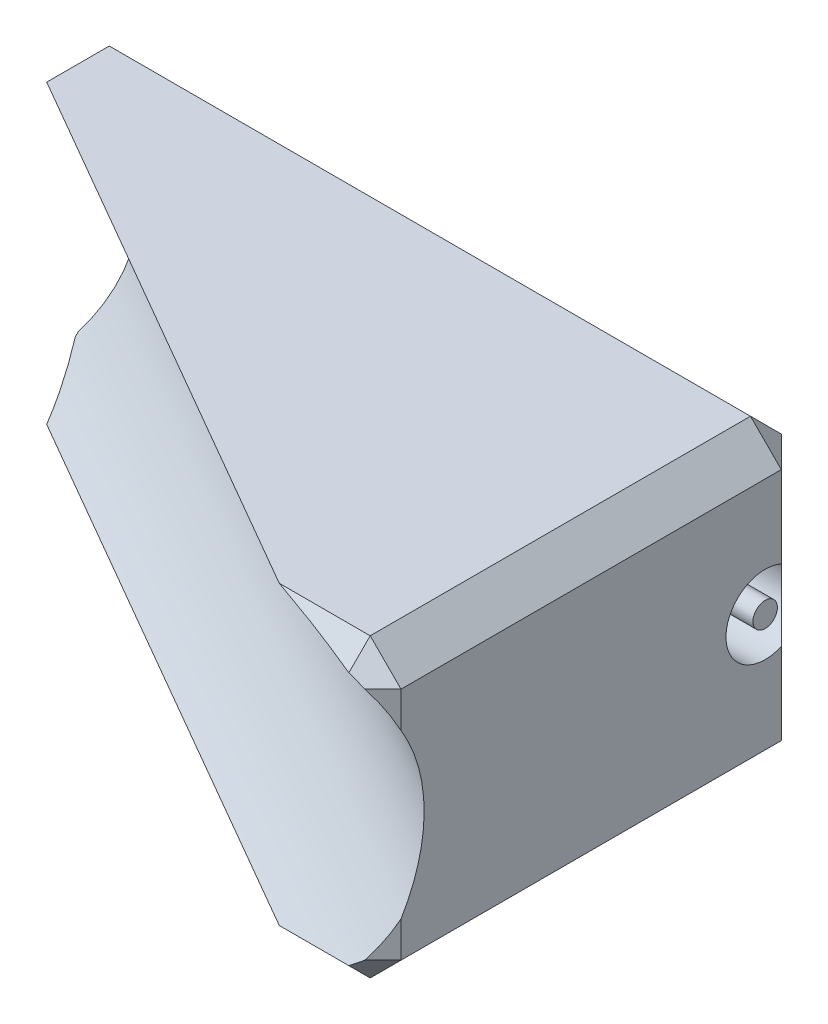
ISO-10303-21;
HEADER;
FILE_DESCRIPTION(('STEP AP214'),'2;1');
FILE_NAME('part.step','',(''),(''),'','','');
FILE_SCHEMA(('AUTOMOTIVE_DESIGN { 1 0 10303 214 1 1 1 1 }'));
ENDSEC;
DATA;
#1=APPLICATION_CONTEXT('core data for automotive mechanical design processes');
#2=APPLICATION_PROTOCOL_DEFINITION('international standard','automotive_design',2000,#1);
#3=PRODUCT_CONTEXT('',#1,'mechanical');
#4=PRODUCT('Part','Part','',(#3));
#5=PRODUCT_RELATED_PRODUCT_CATEGORY('part','',(#4));
#6=PRODUCT_DEFINITION_FORMATION('','',#4);
#7=PRODUCT_DEFINITION_CONTEXT('part definition',#1,'design');
#8=PRODUCT_DEFINITION('design','',#6,#7);
#9=PRODUCT_DEFINITION_SHAPE('','',#8);
#10=(LENGTH_UNIT() NAMED_UNIT(*) SI_UNIT(.MILLI.,.METRE.));
#11=(NAMED_UNIT(*) PLANE_ANGLE_UNIT() SI_UNIT($,.RADIAN.));
#12=(NAMED_UNIT(*) SI_UNIT($,.STERADIAN.) SOLID_ANGLE_UNIT());
#13=UNCERTAINTY_MEASURE_WITH_UNIT(LENGTH_MEASURE(1.E-05),#10,'distance_accuracy_value','');
#14=(GEOMETRIC_REPRESENTATION_CONTEXT(3) GLOBAL_UNCERTAINTY_ASSIGNED_CONTEXT((#13)) GLOBAL_UNIT_ASSIGNED_CONTEXT((#10,
#11,#12)) REPRESENTATION_CONTEXT('',''));
#15=CARTESIAN_POINT('',(0.,0.,0.));
#16=DIRECTION('',(0.,0.,1.));
#17=DIRECTION('',(1.,0.,0.));
#18=AXIS2_PLACEMENT_3D('',#15,#16,#17);
#19=CARTESIAN_POINT('',(127.232621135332,48.07,127.81335182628));
#20=DIRECTION('',(-0.86602540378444,0.,-0.499999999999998));
#21=DIRECTION('',(0.499999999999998,0.,-0.86602540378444));
#22=AXIS2_PLACEMENT_3D('',#19,#20,#21);
#23=CYLINDRICAL_SURFACE('',#22,57.15);
#24=CARTESIAN_POINT('',(-114.,48.07,-11.4623669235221));
#25=DIRECTION('',(1.,0.,0.));
#26=DIRECTION('',(0.,0.,-1.));
#27=AXIS2_PLACEMENT_3D('',#24,#25,#26);
#28=ELLIPSE('',#27,65.9911357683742,57.15);
#29=CARTESIAN_POINT('',(-114.,10.9921832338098,-61.68));
#30=VERTEX_POINT('',#29);
#31=CARTESIAN_POINT('',(-114.,10.,-60.6802173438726));
#32=VERTEX_POINT('',#31);
#33=EDGE_CURVE('E331',#30,#32,#28,.F.);
#34=ORIENTED_EDGE('',*,*,#33,.T.);
#35=CARTESIAN_POINT('',(-152.07,48.07,-33.4420916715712));
#36=DIRECTION('',(-0.707106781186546,-0.707106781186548,0.));
#37=DIRECTION('',(-0.547722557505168,0.547722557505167,-0.632455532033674));
#38=AXIS2_PLACEMENT_3D('',#35,#36,#37);
#39=ELLIPSE('',#38,93.3255592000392,57.15);
#40=CARTESIAN_POINT('',(-104.,0.,-41.380088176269));
#41=VERTEX_POINT('',#40);
#42=EDGE_CURVE('E277',#41,#32,#39,.F.);
#43=ORIENTED_EDGE('',*,*,#42,.F.);
#44=DIRECTION('',(-0.86602540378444,0.,-0.499999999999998));
#45=VECTOR('',#44,1.);
#46=CARTESIAN_POINT('',(142.687374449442,0.,101.044933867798));
#47=LINE('',#46,#45);
#48=CARTESIAN_POINT('',(74.5053089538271,0.,61.6799999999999));
#49=VERTEX_POINT('',#48);
#50=EDGE_CURVE('E209',#49,#41,#47,.T.);
#51=ORIENTED_EDGE('',*,*,#50,.F.);
#52=CARTESIAN_POINT('',(95.9459780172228,48.07,109.75));
#53=DIRECTION('',(0.,-0.707106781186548,0.707106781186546));
#54=DIRECTION('',(-0.925820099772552,-0.267261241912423,-0.267261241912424));
#55=AXIS2_PLACEMENT_3D('',#52,#53,#54);
#56=ELLIPSE('',#55,161.644610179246,57.15);
#57=CARTESIAN_POINT('',(104.,6.92284402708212,68.6028440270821));
#58=VERTEX_POINT('',#57);
#59=EDGE_CURVE('E269',#58,#49,#56,.F.);
#60=ORIENTED_EDGE('',*,*,#59,.F.);
#61=CARTESIAN_POINT('',(101.052023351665,48.07,112.697976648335));
#62=DIRECTION('',(0.577350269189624,-0.577350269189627,0.577350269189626));
#63=DIRECTION('',(-0.66798441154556,-0.740621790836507,-0.0726373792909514));
#64=AXIS2_PLACEMENT_3D('',#61,#62,#63);
#65=ELLIPSE('',#64,72.4632963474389,57.15);
#66=CARTESIAN_POINT('',(108.119477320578,10.,67.5605226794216));
#67=VERTEX_POINT('',#66);
#68=EDGE_CURVE('E257',#67,#58,#65,.F.);
#69=ORIENTED_EDGE('',*,*,#68,.F.);
#70=CARTESIAN_POINT('',(76.9166104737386,48.07,98.7633895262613));
#71=DIRECTION('',(0.707106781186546,0.,0.707106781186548));
#72=DIRECTION('',(-0.707106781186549,0.,0.707106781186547));
#73=AXIS2_PLACEMENT_3D('',#70,#71,#72);
#74=ELLIPSE('',#73,59.1660337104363,57.15);
#75=CARTESIAN_POINT('',(114.,21.6123767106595,61.68));
#76=VERTEX_POINT('',#75);
#77=EDGE_CURVE('E246',#76,#67,#74,.F.);
#78=ORIENTED_EDGE('',*,*,#77,.F.);
#79=CARTESIAN_POINT('',(114.,48.07,120.173494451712));
#80=DIRECTION('',(1.,0.,0.));
#81=DIRECTION('',(0.,0.,-1.));
#82=AXIS2_PLACEMENT_3D('',#79,#80,#81);
#83=ELLIPSE('',#82,65.9911357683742,57.15);
#84=CARTESIAN_POINT('',(114.,74.5276232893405,61.68));
#85=VERTEX_POINT('',#84);
#86=EDGE_CURVE('E202',#85,#76,#83,.F.);
#87=ORIENTED_EDGE('',*,*,#86,.F.);
#88=CARTESIAN_POINT('',(108.119477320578,86.14,67.5605226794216));
#89=VERTEX_POINT('',#88);
#90=EDGE_CURVE('E249',#89,#85,#74,.F.);
#91=ORIENTED_EDGE('',*,*,#90,.F.);
#92=CARTESIAN_POINT('',(101.052023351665,48.07,112.697976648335));
#93=DIRECTION('',(0.577350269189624,0.577350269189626,0.577350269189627));
#94=DIRECTION('',(-0.66798441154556,0.740621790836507,-0.0726373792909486));
#95=AXIS2_PLACEMENT_3D('',#92,#93,#94);
#96=ELLIPSE('',#95,72.4632963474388,57.15);
#97=CARTESIAN_POINT('',(104.,89.2171559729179,68.6028440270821));
#98=VERTEX_POINT('',#97);
#99=EDGE_CURVE('E238',#98,#89,#96,.F.);
#100=ORIENTED_EDGE('',*,*,#99,.F.);
#101=CARTESIAN_POINT('',(95.9459780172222,48.07,109.75));
#102=DIRECTION('',(0.,-0.707106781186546,-0.707106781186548));
#103=DIRECTION('',(-0.925820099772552,0.267261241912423,-0.267261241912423));
#104=AXIS2_PLACEMENT_3D('',#101,#102,#103);
#105=ELLIPSE('',#104,161.644610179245,57.15);
#106=CARTESIAN_POINT('',(74.5053089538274,96.14,61.68));
#107=VERTEX_POINT('',#106);
#108=EDGE_CURVE('E234',#107,#98,#105,.T.);
#109=ORIENTED_EDGE('',*,*,#108,.F.);
#110=DIRECTION('',(-0.86602540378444,0.,-0.499999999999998));
#111=VECTOR('',#110,1.);
#112=CARTESIAN_POINT('',(142.687374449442,96.14,101.044933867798));
#113=LINE('',#112,#111);
#114=CARTESIAN_POINT('',(-104.,96.14,-41.380088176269));
#115=VERTEX_POINT('',#114);
#116=EDGE_CURVE('E359',#107,#115,#113,.T.);
#117=ORIENTED_EDGE('',*,*,#116,.T.);
#118=CARTESIAN_POINT('',(-152.07,48.07,-33.4420916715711));
#119=DIRECTION('',(0.707106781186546,-0.707106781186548,0.));
#120=DIRECTION('',(-0.547722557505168,-0.547722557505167,-0.632455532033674));
#121=AXIS2_PLACEMENT_3D('',#118,#119,#120);
#122=ELLIPSE('',#121,93.3255592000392,57.15);
#123=CARTESIAN_POINT('',(-114.,86.14,-60.6802173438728));
#124=VERTEX_POINT('',#123);
#125=EDGE_CURVE('E231',#124,#115,#122,.T.);
#126=ORIENTED_EDGE('',*,*,#125,.F.);
#127=CARTESIAN_POINT('',(-114.,85.1478167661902,-61.68));
#128=VERTEX_POINT('',#127);
#129=EDGE_CURVE('E326',#124,#128,#28,.F.);
#130=ORIENTED_EDGE('',*,*,#129,.T.);
#131=CARTESIAN_POINT('',(-145.836703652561,48.07,-29.8432963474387));
#132=DIRECTION('',(-0.707106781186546,0.,-0.707106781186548));
#133=DIRECTION('',(-0.707106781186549,0.,0.707106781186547));
#134=AXIS2_PLACEMENT_3D('',#131,#132,#133);
#135=ELLIPSE('',#134,59.1660337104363,57.15);
#136=CARTESIAN_POINT('',(-104.,48.07,-71.68));
#137=VERTEX_POINT('',#136);
#138=EDGE_CURVE('E336',#137,#128,#135,.F.);
#139=ORIENTED_EDGE('',*,*,#138,.F.);
#140=EDGE_CURVE('E223',#30,#137,#135,.F.);
#141=ORIENTED_EDGE('',*,*,#140,.F.);
#142=EDGE_LOOP('',(#34,#43,#51,#60,#69,#78,#87,#91,#100,#109,#117,#126,#130,#139,#141));
#143=FACE_BOUND('',#142,.T.);
#144=CARTESIAN_POINT('',(-66.6050230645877,48.07,-50.09));
#145=CARTESIAN_POINT('',(-66.6050250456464,47.71791765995,-50.0900001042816));
#146=CARTESIAN_POINT('',(-66.6193444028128,47.3657972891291,-50.0945019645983));
#147=CARTESIAN_POINT('',(-66.676480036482,46.6640789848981,-50.1125292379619));
#148=CARTESIAN_POINT('',(-66.7193004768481,46.3144814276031,-50.1260559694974));
#149=CARTESIAN_POINT('',(-66.8330294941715,45.620131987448,-50.1621998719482));
#150=CARTESIAN_POINT('',(-66.9039557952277,45.2753833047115,-50.1848227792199));
#151=CARTESIAN_POINT('',(-67.0731663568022,44.5934248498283,-50.2392468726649));
#152=CARTESIAN_POINT('',(-67.1714496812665,44.2562148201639,-50.2710477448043));
#153=CARTESIAN_POINT('',(-67.394273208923,43.5920234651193,-50.3439088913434));
#154=CARTESIAN_POINT('',(-67.5187852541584,43.2650315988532,-50.3849592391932));
#155=CARTESIAN_POINT('',(-67.7929259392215,42.6231207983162,-50.476484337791));
#156=CARTESIAN_POINT('',(-67.942554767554,42.3082019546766,-50.5269591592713));
#157=CARTESIAN_POINT('',(-68.2655211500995,41.6925524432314,-50.6374943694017));
#158=CARTESIAN_POINT('',(-68.4388572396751,41.3918209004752,-50.6975541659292));
#159=CARTESIAN_POINT('',(-68.8076902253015,40.8064775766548,-50.8274379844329));
#160=CARTESIAN_POINT('',(-69.0031879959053,40.5218664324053,-50.8972623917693));
#161=CARTESIAN_POINT('',(-69.4176896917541,39.9665253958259,-51.047954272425));
#162=CARTESIAN_POINT('',(-69.6369988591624,39.6960635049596,-51.1289699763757));
#163=CARTESIAN_POINT('',(-70.0947837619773,39.1754325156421,-51.3013924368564));
#164=CARTESIAN_POINT('',(-70.3332596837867,38.9252636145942,-51.392799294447));
#165=CARTESIAN_POINT('',(-70.8273900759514,38.4468636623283,-51.5861334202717));
#166=CARTESIAN_POINT('',(-71.083046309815,38.2186348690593,-51.6880617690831));
#167=CARTESIAN_POINT('',(-71.6093935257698,37.7857013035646,-51.9024831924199));
#168=CARTESIAN_POINT('',(-71.8800841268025,37.5809959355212,-52.0149759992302));
#169=CARTESIAN_POINT('',(-72.4374879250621,37.1943212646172,-52.251847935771));
#170=CARTESIAN_POINT('',(-72.724349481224,37.0126402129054,-52.3763487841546));
#171=CARTESIAN_POINT('',(-73.3088354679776,36.6761462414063,-52.6359656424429));
#172=CARTESIAN_POINT('',(-73.6064600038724,36.5213335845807,-52.7710817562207));
#173=CARTESIAN_POINT('',(-74.209991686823,36.239784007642,-53.0515980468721));
#174=CARTESIAN_POINT('',(-74.515898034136,36.1130443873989,-53.1969972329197));
#175=CARTESIAN_POINT('',(-75.1335083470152,35.8886398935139,-53.4975904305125));
#176=CARTESIAN_POINT('',(-75.4452122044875,35.7909744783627,-53.6527842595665));
#177=CARTESIAN_POINT('',(-76.0668495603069,35.6268543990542,-53.9697013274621));
#178=CARTESIAN_POINT('',(-76.3767313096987,35.5599244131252,-54.1312799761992));
#179=CARTESIAN_POINT('',(-76.9972254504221,35.455550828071,-54.4623666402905));
#180=CARTESIAN_POINT('',(-77.3078378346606,35.4181069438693,-54.6318745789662));
#181=CARTESIAN_POINT('',(-77.9273723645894,35.3730239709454,-54.9777232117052));
#182=CARTESIAN_POINT('',(-78.2362946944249,35.3653815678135,-55.1540631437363));
#183=CARTESIAN_POINT('',(-78.8501724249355,35.3799577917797,-55.5123209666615));
#184=CARTESIAN_POINT('',(-79.1551278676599,35.4021761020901,-55.6942387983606));
#185=CARTESIAN_POINT('',(-79.7531744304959,35.4755833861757,-56.0587295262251));
#186=CARTESIAN_POINT('',(-80.0463808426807,35.5262177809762,-56.2412252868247));
#187=CARTESIAN_POINT('',(-80.6249209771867,35.6556378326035,-56.6086838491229));
#188=CARTESIAN_POINT('',(-80.9102548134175,35.7344230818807,-56.7936466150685));
#189=CARTESIAN_POINT('',(-81.471280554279,35.9195282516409,-57.1644319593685));
#190=CARTESIAN_POINT('',(-81.7469720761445,36.0258492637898,-57.350254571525));
#191=CARTESIAN_POINT('',(-82.2870880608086,36.2652141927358,-57.7210586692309));
#192=CARTESIAN_POINT('',(-82.5515123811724,36.3982584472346,-57.9060401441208));
#193=CARTESIAN_POINT('',(-83.069753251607,36.6912854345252,-58.2749169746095));
#194=CARTESIAN_POINT('',(-83.3234653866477,36.8514795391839,-58.4587910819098));
#195=CARTESIAN_POINT('',(-83.8166391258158,37.1968832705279,-58.82209267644));
#196=CARTESIAN_POINT('',(-84.0561006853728,37.3820929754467,-59.0015201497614));
#197=CARTESIAN_POINT('',(-84.5196285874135,37.7762691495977,-59.3541334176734));
#198=CARTESIAN_POINT('',(-84.7436931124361,37.9852384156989,-59.5273184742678));
#199=CARTESIAN_POINT('',(-85.1753557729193,38.4255164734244,-59.8656286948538));
#200=CARTESIAN_POINT('',(-85.3829536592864,38.6568256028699,-60.0307537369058));
#201=CARTESIAN_POINT('',(-85.7852024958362,39.1456815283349,-60.3547696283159));
#202=CARTESIAN_POINT('',(-85.9794600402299,39.4036994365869,-60.513438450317));
#203=CARTESIAN_POINT('',(-86.3488974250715,39.9397692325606,-60.8186941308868));
#204=CARTESIAN_POINT('',(-86.5240769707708,40.2178214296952,-60.9652808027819));
#205=CARTESIAN_POINT('',(-86.8545577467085,40.792101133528,-61.2446413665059));
#206=CARTESIAN_POINT('',(-87.009858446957,41.0883291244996,-61.3774148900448));
#207=CARTESIAN_POINT('',(-87.2998516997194,41.6969523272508,-61.627520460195));
#208=CARTESIAN_POINT('',(-87.4345443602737,42.0093474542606,-61.7448525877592));
#209=CARTESIAN_POINT('',(-87.6829608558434,42.6488957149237,-61.9628405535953));
#210=CARTESIAN_POINT('',(-87.7966362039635,42.9760808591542,-62.063457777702));
#211=CARTESIAN_POINT('',(-88.0020718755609,43.6422479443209,-62.2463688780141));
#212=CARTESIAN_POINT('',(-88.0938321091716,43.9812299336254,-62.3286626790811));
#213=CARTESIAN_POINT('',(-88.2549523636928,44.6685106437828,-62.4738030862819));
#214=CARTESIAN_POINT('',(-88.3243151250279,45.0168082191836,-62.536652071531));
#215=CARTESIAN_POINT('',(-88.4402831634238,45.7201975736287,-62.642041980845));
#216=CARTESIAN_POINT('',(-88.4868888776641,46.0752892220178,-62.6845832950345));
#217=CARTESIAN_POINT('',(-88.5563687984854,46.7822916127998,-62.7480993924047));
#218=CARTESIAN_POINT('',(-88.5797095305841,47.1341185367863,-62.7694980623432));
#219=CARTESIAN_POINT('',(-88.6041872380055,47.8391893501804,-62.7919407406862));
#220=CARTESIAN_POINT('',(-88.6053245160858,48.1924332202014,-62.7929850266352));
#221=CARTESIAN_POINT('',(-88.5853902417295,48.8977407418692,-62.7747054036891));
#222=CARTESIAN_POINT('',(-88.5643201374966,49.2498044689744,-62.7553828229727));
#223=CARTESIAN_POINT('',(-88.5000867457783,49.9502178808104,-62.6966377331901));
#224=CARTESIAN_POINT('',(-88.4569235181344,50.2985675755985,-62.6572152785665));
#225=CARTESIAN_POINT('',(-88.3493497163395,50.9851134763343,-62.5593690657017));
#226=CARTESIAN_POINT('',(-88.2851867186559,51.3233801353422,-62.501166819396));
#227=CARTESIAN_POINT('',(-88.1358163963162,51.9914986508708,-62.3664048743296));
#228=CARTESIAN_POINT('',(-88.0506092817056,52.3213505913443,-62.2898453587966));
#229=CARTESIAN_POINT('',(-87.8595599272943,52.9704326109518,-62.119339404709));
#230=CARTESIAN_POINT('',(-87.7537163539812,53.2896620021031,-62.0253918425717));
#231=CARTESIAN_POINT('',(-87.52189467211,53.91536900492,-61.8212764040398));
#232=CARTESIAN_POINT('',(-87.3959162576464,54.2218464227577,-61.7111082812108));
#233=CARTESIAN_POINT('',(-87.1224062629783,54.8244467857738,-61.4741493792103));
#234=CARTESIAN_POINT('',(-86.9745859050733,55.1203521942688,-61.3471386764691));
#235=CARTESIAN_POINT('',(-86.6594761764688,55.6950448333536,-61.0792975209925));
#236=CARTESIAN_POINT('',(-86.4921866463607,55.9738319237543,-60.9384669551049));
#237=CARTESIAN_POINT('',(-86.1388632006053,56.5125053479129,-60.6445974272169));
#238=CARTESIAN_POINT('',(-85.9528270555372,56.7723894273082,-60.4915570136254));
#239=CARTESIAN_POINT('',(-85.5628537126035,57.2715271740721,-60.1749977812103));
#240=CARTESIAN_POINT('',(-85.3589163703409,57.5107806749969,-60.0114788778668));
#241=CARTESIAN_POINT('',(-84.9299995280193,57.9714387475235,-59.6725343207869));
#242=CARTESIAN_POINT('',(-84.7046926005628,58.1924152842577,-59.4969409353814));
#243=CARTESIAN_POINT('',(-84.2375291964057,58.6097563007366,-59.1386507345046));
#244=CARTESIAN_POINT('',(-83.9956724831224,58.8061204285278,-58.9559538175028));
#245=CARTESIAN_POINT('',(-83.4966470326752,59.1728103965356,-58.5854223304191));
#246=CARTESIAN_POINT('',(-83.2394786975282,59.3431369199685,-58.397587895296));
#247=CARTESIAN_POINT('',(-82.7112170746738,59.6564774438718,-58.0187424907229));
#248=CARTESIAN_POINT('',(-82.4401239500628,59.7994917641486,-57.8277315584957));
#249=CARTESIAN_POINT('',(-81.8871778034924,60.0563508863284,-57.4455772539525));
#250=CARTESIAN_POINT('',(-81.6053957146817,60.1703588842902,-57.2544409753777));
#251=CARTESIAN_POINT('',(-81.0313445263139,60.3693591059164,-56.872802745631));
#252=CARTESIAN_POINT('',(-80.7390754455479,60.4543513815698,-56.6823007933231));
#253=CARTESIAN_POINT('',(-80.1460086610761,60.5946048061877,-56.3037312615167));
#254=CARTESIAN_POINT('',(-79.8452121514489,60.6498700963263,-56.1156633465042));
#255=CARTESIAN_POINT('',(-79.2371461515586,60.7302161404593,-55.7435909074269));
#256=CARTESIAN_POINT('',(-78.9298767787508,60.7552974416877,-55.5595863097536));
#257=CARTESIAN_POINT('',(-78.3180951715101,60.7748383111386,-55.2012331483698));
#258=CARTESIAN_POINT('',(-78.0136771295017,60.7699759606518,-55.0267603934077));
#259=CARTESIAN_POINT('',(-77.4030112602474,60.7312506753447,-54.6843676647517));
#260=CARTESIAN_POINT('',(-77.0967634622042,60.6973882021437,-54.5164475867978));
#261=CARTESIAN_POINT('',(-76.4847250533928,60.6009425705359,-54.1882156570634));
#262=CARTESIAN_POINT('',(-76.1789344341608,60.5383599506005,-54.0279036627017));
#263=CARTESIAN_POINT('',(-75.5701238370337,60.3849795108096,-53.7157442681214));
#264=CARTESIAN_POINT('',(-75.2671038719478,60.2941815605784,-53.5638969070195));
#265=CARTESIAN_POINT('',(-74.6672833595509,60.0854749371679,-53.2698863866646));
#266=CARTESIAN_POINT('',(-74.3704638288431,59.9676686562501,-53.1276892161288));
#267=CARTESIAN_POINT('',(-73.7841584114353,59.7056487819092,-52.8528423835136));
#268=CARTESIAN_POINT('',(-73.4946724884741,59.5614353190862,-52.7201926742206));
#269=CARTESIAN_POINT('',(-72.925234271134,59.2476344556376,-52.4647475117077));
#270=CARTESIAN_POINT('',(-72.6452827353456,59.0780450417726,-52.341952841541));
#271=CARTESIAN_POINT('',(-72.0970926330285,58.7146822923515,-52.1064039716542));
#272=CARTESIAN_POINT('',(-71.828854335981,58.5209084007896,-51.9936500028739));
#273=CARTESIAN_POINT('',(-71.300727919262,58.1062016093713,-51.7759986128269));
#274=CARTESIAN_POINT('',(-71.041130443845,57.8847867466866,-51.6713139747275));
#275=CARTESIAN_POINT('',(-70.5384473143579,57.4196226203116,-51.4724411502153));
#276=CARTESIAN_POINT('',(-70.2953619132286,57.1758730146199,-51.3782531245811));
#277=CARTESIAN_POINT('',(-69.8276831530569,56.6676091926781,-51.2002504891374));
#278=CARTESIAN_POINT('',(-69.6030940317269,56.4030902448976,-51.1164382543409));
#279=CARTESIAN_POINT('',(-69.1743982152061,55.8550870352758,-50.9590632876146));
#280=CARTESIAN_POINT('',(-68.9702914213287,55.5716028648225,-50.8855005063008));
#281=CARTESIAN_POINT('',(-68.5817508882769,54.9835855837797,-50.7475209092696));
#282=CARTESIAN_POINT('',(-68.3976206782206,54.6788195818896,-50.6832412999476));
#283=CARTESIAN_POINT('',(-68.0539884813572,54.0538179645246,-50.5648415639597));
#284=CARTESIAN_POINT('',(-67.8944863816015,53.7335824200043,-50.5107213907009));
#285=CARTESIAN_POINT('',(-67.601773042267,53.0801172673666,-50.4124938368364));
#286=CARTESIAN_POINT('',(-67.4685430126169,52.7468971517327,-50.3683792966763));
#287=CARTESIAN_POINT('',(-67.2295947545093,52.0696512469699,-50.2899557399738));
#288=CARTESIAN_POINT('',(-67.123871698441,51.7256273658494,-50.2556450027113));
#289=CARTESIAN_POINT('',(-66.9618214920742,51.1085120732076,-50.2033961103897));
#290=CARTESIAN_POINT('',(-66.899728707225,50.8370819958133,-50.1835090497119));
#291=CARTESIAN_POINT('',(-66.7929937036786,50.2904644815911,-50.1494530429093));
#292=CARTESIAN_POINT('',(-66.7483501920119,50.0152773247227,-50.1352836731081));
#293=CARTESIAN_POINT('',(-66.6768004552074,49.4623462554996,-50.1126261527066));
#294=CARTESIAN_POINT('',(-66.649895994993,49.1846020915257,-50.1041385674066));
#295=CARTESIAN_POINT('',(-66.6140083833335,48.6279130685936,-50.0928260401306));
#296=CARTESIAN_POINT('',(-66.6050214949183,48.3489684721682,-50.0899999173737));
#297=CARTESIAN_POINT('',(-66.6050230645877,48.07,-50.09));
#298=B_SPLINE_CURVE_WITH_KNOTS('',3,(#144,#145,#146,#147,#148,#149,#150,#151,#152,#153,#154,
#155,#156,#157,#158,#159,#160,#161,#162,#163,#164,#165,#166,#167,#168,#169,#170,#171,#172,#173,
#174,#175,#176,#177,#178,#179,#180,#181,#182,#183,#184,#185,#186,#187,#188,#189,#190,#191,#192,
#193,#194,#195,#196,#197,#198,#199,#200,#201,#202,#203,#204,#205,#206,#207,#208,#209,#210,#211,
#212,#213,#214,#215,#216,#217,#218,#219,#220,#221,#222,#223,#224,#225,#226,#227,#228,#229,#230,
#231,#232,#233,#234,#235,#236,#237,#238,#239,#240,#241,#242,#243,#244,#245,#246,#247,#248,#249,
#250,#251,#252,#253,#254,#255,#256,#257,#258,#259,#260,#261,#262,#263,#264,#265,#266,#267,#268,
#269,#270,#271,#272,#273,#274,#275,#276,#277,#278,#279,#280,#281,#282,#283,#284,#285,#286,#287,
#288,#289,#290,#291,#292,#293,#294,#295,#296,#297),.UNSPECIFIED.,.T.,.F.,(4,2,2,2,2,2,2,2,2,2,2,
2,2,2,2,2,2,2,2,2,2,2,2,2,2,2,2,2,2,2,2,2,2,2,2,2,2,2,2,2,2,2,2,2,2,2,2,2,2,2,2,2,2,2,2,2,2,2,2,
2,2,2,2,2,2,2,2,2,2,2,2,2,2,2,2,2,4),(0.,1.05599403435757,2.11214237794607,3.16895781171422,
4.22573708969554,5.28138758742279,6.33704600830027,7.39263923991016,8.44827414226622,
9.51954274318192,10.5908217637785,11.6622109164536,12.7335729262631,13.817244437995,
14.9009265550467,15.9845043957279,17.0680620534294,18.1342460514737,19.2004197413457,
20.2664748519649,21.3325186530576,22.3784465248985,23.4243592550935,24.4703134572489,
25.5162808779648,26.5708008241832,27.6253240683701,28.6799715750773,29.7346350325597,
30.8128864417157,31.8911545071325,32.9694513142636,34.0477424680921,35.1284910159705,
36.2092439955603,37.2898646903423,38.3704646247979,39.4289312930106,40.4873835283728,
41.5457667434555,42.6041470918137,43.6504739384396,44.6967903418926,45.7431743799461,
46.7895743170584,47.851307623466,48.9130496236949,49.9749180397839,51.0367950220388,
52.1189474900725,53.2011154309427,54.2832549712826,55.3653818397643,56.4412786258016,
57.5171734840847,58.5929184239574,59.6686438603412,60.7201001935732,61.7715397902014,
62.8229596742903,63.8743844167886,64.9218871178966,65.9693846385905,67.0169653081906,
68.0645700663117,69.134013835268,70.203473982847,71.2731784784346,72.3428778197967,
73.4270497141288,74.5112166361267,75.5946053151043,76.6778037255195,77.5146620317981,
78.3514583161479,79.188337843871,80.0250428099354),.UNSPECIFIED.);
#299=CARTESIAN_POINT('',(-76.2256555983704,35.5962573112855,-54.0534243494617));
#300=VERTEX_POINT('',#299);
#301=CARTESIAN_POINT('',(-76.2256555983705,60.5437426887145,-54.0534243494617));
#302=VERTEX_POINT('',#301);
#303=EDGE_CURVE('E65',#300,#302,#298,.T.);
#304=ORIENTED_EDGE('',*,*,#303,.T.);
#305=CARTESIAN_POINT('',(-86.1752294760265,60.3008757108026,-59.8598946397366));
#306=CARTESIAN_POINT('',(-85.8943235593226,60.3496690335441,-59.6853674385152));
#307=CARTESIAN_POINT('',(-85.6124623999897,60.3943307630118,-59.5112612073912));
#308=CARTESIAN_POINT('',(-85.0470413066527,60.4757127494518,-59.163990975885));
#309=CARTESIAN_POINT('',(-84.7634814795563,60.5124335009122,-58.9908269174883));
#310=CARTESIAN_POINT('',(-83.9107198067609,60.6111518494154,-58.4729879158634));
#311=CARTESIAN_POINT('',(-83.3392369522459,60.6617395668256,-58.1298426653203));
#312=CARTESIAN_POINT('',(-82.1919658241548,60.734534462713,-57.448420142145));
#313=CARTESIAN_POINT('',(-81.6161794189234,60.7567533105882,-57.1101409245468));
#314=CARTESIAN_POINT('',(-80.4611909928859,60.7744402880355,-56.438654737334));
#315=CARTESIAN_POINT('',(-79.8819886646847,60.7699059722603,-56.1054482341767));
#316=CARTESIAN_POINT('',(-78.714326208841,60.7350348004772,-55.4404620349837));
#317=CARTESIAN_POINT('',(-78.1258384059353,60.7043888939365,-55.1087474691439));
#318=CARTESIAN_POINT('',(-76.9475222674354,60.6176748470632,-54.4510619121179));
#319=CARTESIAN_POINT('',(-76.3576939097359,60.5616062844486,-54.1250910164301));
#320=CARTESIAN_POINT('',(-75.1777214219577,60.4244378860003,-53.4791067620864));
#321=CARTESIAN_POINT('',(-74.5875773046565,60.3433389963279,-53.1590931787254));
#322=CARTESIAN_POINT('',(-73.4079815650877,60.1560951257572,-52.5252158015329));
#323=CARTESIAN_POINT('',(-72.8185299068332,60.0499515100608,-52.2113516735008));
#324=CARTESIAN_POINT('',(-71.8391311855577,59.8520935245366,-51.6943664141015));
#325=CARTESIAN_POINT('',(-71.4486740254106,59.7675073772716,-51.4894577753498));
#326=CARTESIAN_POINT('',(-70.6689175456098,59.5868227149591,-51.0825415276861));
#327=CARTESIAN_POINT('',(-70.2796181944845,59.4907245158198,-50.8805338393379));
#328=CARTESIAN_POINT('',(-69.5025658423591,59.2866502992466,-50.4795155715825));
#329=CARTESIAN_POINT('',(-69.1148129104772,59.1786737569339,-50.2805051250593));
#330=CARTESIAN_POINT('',(-68.3413444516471,58.9503588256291,-49.8856266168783));
#331=CARTESIAN_POINT('',(-67.9556289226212,58.8300204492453,-49.6897585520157));
#332=CARTESIAN_POINT('',(-67.1885967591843,58.5769421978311,-49.3022502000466));
#333=CARTESIAN_POINT('',(-66.8072679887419,58.4442629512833,-49.1105944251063));
#334=CARTESIAN_POINT('',(-66.0478740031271,58.1652392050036,-48.7308058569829));
#335=CARTESIAN_POINT('',(-65.6698086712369,58.0188951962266,-48.5426729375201));
#336=CARTESIAN_POINT('',(-64.9179399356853,57.7116024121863,-48.17031115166));
#337=CARTESIAN_POINT('',(-64.5441346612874,57.550660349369,-47.9860805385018));
#338=CARTESIAN_POINT('',(-63.801720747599,57.2128729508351,-47.621860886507));
#339=CARTESIAN_POINT('',(-63.4331113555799,57.0360299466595,-47.4418712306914));
#340=CARTESIAN_POINT('',(-62.7723041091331,56.7003196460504,-47.1206261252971));
#341=CARTESIAN_POINT('',(-62.478970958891,56.5444796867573,-46.9785442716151));
#342=CARTESIAN_POINT('',(-61.89756523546,56.2203046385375,-46.6979001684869));
#343=CARTESIAN_POINT('',(-61.6094924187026,56.0519701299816,-46.5593377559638));
#344=CARTESIAN_POINT('',(-61.0390855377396,55.7010890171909,-46.2858828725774));
#345=CARTESIAN_POINT('',(-60.7567686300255,55.5185060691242,-46.1510010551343));
#346=CARTESIAN_POINT('',(-60.2003217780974,55.138005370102,-45.8859930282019));
#347=CARTESIAN_POINT('',(-59.9261915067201,54.9400882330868,-45.7558666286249));
#348=CARTESIAN_POINT('',(-59.385111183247,54.5246252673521,-45.4997947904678));
#349=CARTESIAN_POINT('',(-59.118286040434,54.3068731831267,-45.3739178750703));
#350=CARTESIAN_POINT('',(-58.598334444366,53.8514756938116,-45.1293243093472));
#351=CARTESIAN_POINT('',(-58.3452136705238,53.6138221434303,-45.0106106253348));
#352=CARTESIAN_POINT('',(-57.8582331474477,53.1172097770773,-44.7828122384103));
#353=CARTESIAN_POINT('',(-57.6242985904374,52.8583424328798,-44.6736900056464));
#354=CARTESIAN_POINT('',(-57.1809973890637,52.316219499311,-44.4673822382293));
#355=CARTESIAN_POINT('',(-56.9716002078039,52.0329950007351,-44.3701818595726));
#356=CARTESIAN_POINT('',(-56.5940585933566,51.4529458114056,-44.1952683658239));
#357=CARTESIAN_POINT('',(-56.4245191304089,51.1572433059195,-44.1168930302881));
#358=CARTESIAN_POINT('',(-56.1255184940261,50.5416539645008,-43.9788647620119));
#359=CARTESIAN_POINT('',(-55.996030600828,50.2217834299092,-43.9191993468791));
#360=CARTESIAN_POINT('',(-55.8396923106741,49.7254570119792,-43.8472244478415));
#361=CARTESIAN_POINT('',(-55.7937323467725,49.556170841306,-43.8260787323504));
#362=CARTESIAN_POINT('',(-55.7162089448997,49.2135927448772,-43.7904230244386));
#363=CARTESIAN_POINT('',(-55.6846450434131,49.0403009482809,-43.775912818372));
#364=CARTESIAN_POINT('',(-55.6369782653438,48.6913239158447,-43.7540037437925));
#365=CARTESIAN_POINT('',(-55.620860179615,48.5156412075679,-43.7465978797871));
#366=CARTESIAN_POINT('',(-55.6045901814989,48.1633839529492,-43.7391222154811));
#367=CARTESIAN_POINT('',(-55.6044366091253,47.9868095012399,-43.7390516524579));
#368=CARTESIAN_POINT('',(-55.619169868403,47.65525339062,-43.7458212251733));
#369=CARTESIAN_POINT('',(-55.6322913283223,47.5001727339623,-43.7518502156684));
#370=CARTESIAN_POINT('',(-55.6706059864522,47.1917828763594,-43.7694596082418));
#371=CARTESIAN_POINT('',(-55.6958031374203,47.0384742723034,-43.781041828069));
#372=CARTESIAN_POINT('',(-55.7576404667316,46.7346381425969,-43.8094772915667));
#373=CARTESIAN_POINT('',(-55.7942847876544,46.5841116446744,-43.8263324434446));
#374=CARTESIAN_POINT('',(-55.8781689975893,46.2866695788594,-43.8649357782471));
#375=CARTESIAN_POINT('',(-55.9254115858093,46.1397549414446,-43.8866852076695));
#376=CARTESIAN_POINT('',(-56.0477121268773,45.7995856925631,-43.9430238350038));
#377=CARTESIAN_POINT('',(-56.1267236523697,45.6080505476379,-43.9794451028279));
#378=CARTESIAN_POINT('',(-56.2998638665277,45.2334698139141,-44.0593368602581));
#379=CARTESIAN_POINT('',(-56.3939988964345,45.0504278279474,-44.1028103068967));
#380=CARTESIAN_POINT('',(-56.5952584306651,44.6928231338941,-44.1958634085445));
#381=CARTESIAN_POINT('',(-56.7024072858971,44.518277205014,-44.245454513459));
#382=CARTESIAN_POINT('',(-56.9274844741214,44.1779909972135,-44.3497589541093));
#383=CARTESIAN_POINT('',(-57.0454113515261,44.0122495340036,-44.4044715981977));
#384=CARTESIAN_POINT('',(-57.3750404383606,43.5774513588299,-44.5576170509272));
#385=CARTESIAN_POINT('',(-57.5951933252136,43.3162152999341,-44.660117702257));
#386=CARTESIAN_POINT('',(-58.0548805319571,42.8156362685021,-44.8747122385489));
#387=CARTESIAN_POINT('',(-58.2944291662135,42.576309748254,-44.9868132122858));
#388=CARTESIAN_POINT('',(-58.7886333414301,42.1168692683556,-45.2187454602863));
#389=CARTESIAN_POINT('',(-59.0433172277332,41.8967933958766,-45.3385912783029));
#390=CARTESIAN_POINT('',(-59.563927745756,41.4742565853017,-45.5843161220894));
#391=CARTESIAN_POINT('',(-59.8298520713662,41.2717920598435,-45.7101939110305));
#392=CARTESIAN_POINT('',(-60.3810810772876,40.8749556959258,-45.9719530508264));
#393=CARTESIAN_POINT('',(-60.6667371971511,40.6812060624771,-46.10803306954));
#394=CARTESIAN_POINT('',(-61.2456393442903,40.3088167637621,-46.3847603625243));
#395=CARTESIAN_POINT('',(-61.5388870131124,40.130180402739,-46.5254086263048));
#396=CARTESIAN_POINT('',(-62.1316628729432,39.7864495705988,-46.8107364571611));
#397=CARTESIAN_POINT('',(-62.4311962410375,39.6213668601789,-46.9554193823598));
#398=CARTESIAN_POINT('',(-63.0351264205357,39.3037135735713,-47.2482173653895));
#399=CARTESIAN_POINT('',(-63.3395229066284,39.151142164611,-47.3963321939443));
#400=CARTESIAN_POINT('',(-63.9532580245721,38.8570399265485,-47.6961109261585));
#401=CARTESIAN_POINT('',(-64.2626090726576,38.7155448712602,-47.8477844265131));
#402=CARTESIAN_POINT('',(-64.8846041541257,38.4432997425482,-48.1539532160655));
#403=CARTESIAN_POINT('',(-65.1972481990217,38.3125497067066,-48.3084485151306));
#404=CARTESIAN_POINT('',(-66.1390085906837,37.9354405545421,-48.7757228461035));
#405=CARTESIAN_POINT('',(-66.7722333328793,37.704090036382,-49.0924270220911));
#406=CARTESIAN_POINT('',(-68.0152826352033,37.2876238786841,-49.7195113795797));
#407=CARTESIAN_POINT('',(-68.6247654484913,37.1008181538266,-50.0294615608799));
#408=CARTESIAN_POINT('',(-69.8483493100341,36.7573633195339,-50.6570744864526));
#409=CARTESIAN_POINT('',(-70.4624510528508,36.6007188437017,-50.9747384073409));
#410=CARTESIAN_POINT('',(-71.6940360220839,36.3159479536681,-51.6175604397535));
#411=CARTESIAN_POINT('',(-72.3115217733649,36.1878470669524,-51.9427249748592));
#412=CARTESIAN_POINT('',(-73.54791473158,35.9594696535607,-52.5999403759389));
#413=CARTESIAN_POINT('',(-74.1668218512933,35.8591914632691,-52.9319908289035));
#414=CARTESIAN_POINT('',(-75.403232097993,35.686369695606,-53.6018623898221));
#415=CARTESIAN_POINT('',(-76.0207346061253,35.6137534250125,-53.9396659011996));
#416=CARTESIAN_POINT('',(-77.2548718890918,35.4960769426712,-54.6216991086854));
#417=CARTESIAN_POINT('',(-77.8715066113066,35.4510183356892,-54.9659291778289));
#418=CARTESIAN_POINT('',(-79.1021714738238,35.3891739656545,-55.6602450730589));
#419=CARTESIAN_POINT('',(-79.7162034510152,35.3723629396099,-56.0103253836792));
#420=CARTESIAN_POINT('',(-80.940930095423,35.3681001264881,-56.7163007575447));
#421=CARTESIAN_POINT('',(-81.551625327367,35.3806432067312,-57.072194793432));
#422=CARTESIAN_POINT('',(-82.4984064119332,35.424319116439,-57.630275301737));
#423=CARTESIAN_POINT('',(-82.836112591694,35.4447347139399,-57.8305992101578));
#424=CARTESIAN_POINT('',(-83.5097909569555,35.4955448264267,-58.2328091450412));
#425=CARTESIAN_POINT('',(-83.8457633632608,35.5259380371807,-58.4346949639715));
#426=CARTESIAN_POINT('',(-84.5153416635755,35.5970825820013,-58.8397040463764));
#427=CARTESIAN_POINT('',(-84.8489498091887,35.6378221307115,-59.0428256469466));
#428=CARTESIAN_POINT('',(-85.5138906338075,35.7301844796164,-59.4504036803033));
#429=CARTESIAN_POINT('',(-85.8452230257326,35.7818086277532,-59.6548602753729));
#430=CARTESIAN_POINT('',(-86.1752294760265,35.8391242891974,-59.8598946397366));
#431=B_SPLINE_CURVE_WITH_KNOTS('',3,(#305,#306,#307,#308,#309,#310,#311,#312,#313,#314,#315,
#316,#317,#318,#319,#320,#321,#322,#323,#324,#325,#326,#327,#328,#329,#330,#331,#332,#333,#334,
#335,#336,#337,#338,#339,#340,#341,#342,#343,#344,#345,#346,#347,#348,#349,#350,#351,#352,#353,
#354,#355,#356,#357,#358,#359,#360,#361,#362,#363,#364,#365,#366,#367,#368,#369,#370,#371,#372,
#373,#374,#375,#376,#377,#378,#379,#380,#381,#382,#383,#384,#385,#386,#387,#388,#389,#390,#391,
#392,#393,#394,#395,#396,#397,#398,#399,#400,#401,#402,#403,#404,#405,#406,#407,#408,#409,#410,
#411,#412,#413,#414,#415,#416,#417,#418,#419,#420,#421,#422,#423,#424,#425,#426,#427,#428,#429,
#430),.UNSPECIFIED.,.F.,.F.,(4,2,2,2,2,2,2,2,2,2,2,2,2,2,2,2,2,2,2,2,2,2,2,2,2,2,2,2,2,2,2,2,2,
2,2,2,2,2,2,2,2,2,2,2,2,2,2,2,2,2,2,2,2,2,2,2,2,2,2,2,2,2,4),(0.,1.0028025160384,
2.00554256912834,4.01031390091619,6.01426031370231,8.01838989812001,10.0465747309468,
12.0747932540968,14.1029351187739,16.1309664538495,17.4778195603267,18.824635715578,
20.1715114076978,21.5183857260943,22.8589612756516,24.1994886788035,25.5394027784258,
26.8791207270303,27.9627017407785,29.0462324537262,30.1326234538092,31.2189709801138,
32.3182971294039,33.4180754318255,34.5133387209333,35.6072241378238,36.6536788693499,
37.6994339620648,38.2288489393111,38.7582468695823,39.2871229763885,39.8159440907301,
40.28262010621,40.7494489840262,41.2164469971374,41.6835640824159,42.3136864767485,
42.9440737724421,43.5756593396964,44.2071597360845,45.2753937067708,46.3444233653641,
47.4155223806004,48.4864027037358,49.5989864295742,50.7118127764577,51.8255947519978,
52.9393025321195,54.0564704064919,55.1736421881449,57.4069713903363,59.53274302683,
61.6588409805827,63.7868328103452,65.9146973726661,68.036930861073,70.1592879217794,
72.2797458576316,74.3998330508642,75.5792655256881,76.7585438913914,77.9364849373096,
79.1145719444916),.UNSPECIFIED.);
#432=EDGE_CURVE('E190',#302,#300,#431,.T.);
#433=ORIENTED_EDGE('',*,*,#432,.T.);
#434=EDGE_LOOP('',(#304,#433));
#435=FACE_BOUND('',#434,.T.);
#436=ADVANCED_FACE('F52',(#143,#435),#23,.F.);
#437=CARTESIAN_POINT('',(114.,96.14,-71.68));
#438=DIRECTION('',(1.,0.,0.));
#439=DIRECTION('',(0.,0.,-1.));
#440=AXIS2_PLACEMENT_3D('',#437,#438,#439);
#441=PLANE('',#440);
#442=DIRECTION('',(0.,1.,0.));
#443=VECTOR('',#442,1.);
#444=CARTESIAN_POINT('',(114.,96.14,-61.6799999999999));
#445=LINE('',#444,#443);
#446=CARTESIAN_POINT('',(114.,10.,-61.6799999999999));
#447=VERTEX_POINT('',#446);
#448=CARTESIAN_POINT('',(114.,36.5014045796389,-61.6799999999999));
#449=VERTEX_POINT('',#448);
#450=EDGE_CURVE('E178',#447,#449,#445,.T.);
#451=ORIENTED_EDGE('',*,*,#450,.T.);
#452=CARTESIAN_POINT('',(114.,48.07,-56.44));
#453=DIRECTION('',(1.,0.,0.));
#454=DIRECTION('',(0.,0.,-1.));
#455=AXIS2_PLACEMENT_3D('',#452,#453,#454);
#456=CIRCLE('',#455,12.7);
#457=CARTESIAN_POINT('',(114.,59.6385954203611,-61.6799999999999));
#458=VERTEX_POINT('',#457);
#459=EDGE_CURVE('E169',#449,#458,#456,.F.);
#460=ORIENTED_EDGE('',*,*,#459,.T.);
#461=CARTESIAN_POINT('',(114.,86.14,-61.6799999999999));
#462=VERTEX_POINT('',#461);
#463=EDGE_CURVE('E177',#458,#462,#445,.T.);
#464=ORIENTED_EDGE('',*,*,#463,.T.);
#465=DIRECTION('',(0.,0.,1.));
#466=VECTOR('',#465,1.);
#467=CARTESIAN_POINT('',(114.,86.14,71.68));
#468=LINE('',#467,#466);
#469=CARTESIAN_POINT('',(114.,86.14,61.68));
#470=VERTEX_POINT('',#469);
#471=EDGE_CURVE('E196',#462,#470,#468,.T.);
#472=ORIENTED_EDGE('',*,*,#471,.T.);
#473=DIRECTION('',(0.,-1.,0.));
#474=VECTOR('',#473,1.);
#475=CARTESIAN_POINT('',(114.,0.,61.68));
#476=LINE('',#475,#474);
#477=EDGE_CURVE('E198',#470,#85,#476,.T.);
#478=ORIENTED_EDGE('',*,*,#477,.T.);
#479=ORIENTED_EDGE('',*,*,#86,.T.);
#480=CARTESIAN_POINT('',(114.,10.,61.68));
#481=VERTEX_POINT('',#480);
#482=EDGE_CURVE('E204',#76,#481,#476,.T.);
#483=ORIENTED_EDGE('',*,*,#482,.T.);
#484=DIRECTION('',(0.,0.,-1.));
#485=VECTOR('',#484,1.);
#486=CARTESIAN_POINT('',(114.,10.,-71.68));
#487=LINE('',#486,#485);
#488=EDGE_CURVE('E188',#481,#447,#487,.T.);
#489=ORIENTED_EDGE('',*,*,#488,.T.);
#490=EDGE_LOOP('',(#451,#460,#464,#472,#478,#479,#483,#489));
#491=FACE_BOUND('',#490,.T.);
#492=ADVANCED_FACE('F54',(#491),#441,.T.);
#493=CARTESIAN_POINT('',(104.,10.,-71.68));
#494=DIRECTION('',(0.577350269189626,-0.577350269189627,-0.577350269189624));
#495=DIRECTION('',(0.707106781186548,0.707106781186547,0.));
#496=AXIS2_PLACEMENT_3D('',#493,#494,#495);
#497=PLANE('',#496);
#498=DIRECTION('',(0.707106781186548,0.707106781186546,0.));
#499=VECTOR('',#498,1.);
#500=CARTESIAN_POINT('',(109.,5.00000000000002,-61.6799999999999));
#501=LINE('',#500,#499);
#502=CARTESIAN_POINT('',(104.,0.,-61.6799999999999));
#503=VERTEX_POINT('',#502);
#504=EDGE_CURVE('E215',#503,#447,#501,.T.);
#505=ORIENTED_EDGE('',*,*,#504,.F.);
#506=DIRECTION('',(0.,-0.707106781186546,0.707106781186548));
#507=VECTOR('',#506,1.);
#508=CARTESIAN_POINT('',(104.,10.,-71.68));
#509=LINE('',#508,#507);
#510=CARTESIAN_POINT('',(104.,10.,-71.68));
#511=VERTEX_POINT('',#510);
#512=EDGE_CURVE('E262',#503,#511,#509,.F.);
#513=ORIENTED_EDGE('',*,*,#512,.T.);
#514=DIRECTION('',(-0.707106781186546,0.,-0.707106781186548));
#515=VECTOR('',#514,1.);
#516=CARTESIAN_POINT('',(104.,10.,-71.68));
#517=LINE('',#516,#515);
#518=EDGE_CURVE('E185',#447,#511,#517,.T.);
#519=ORIENTED_EDGE('',*,*,#518,.F.);
#520=EDGE_LOOP('',(#505,#513,#519));
#521=FACE_BOUND('',#520,.T.);
#522=ADVANCED_FACE('F321',(#521),#497,.T.);
#523=CARTESIAN_POINT('',(104.,86.14,-71.68));
#524=DIRECTION('',(0.577350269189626,0.577350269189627,-0.577350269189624));
#525=DIRECTION('',(-0.707106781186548,0.707106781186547,0.));
#526=AXIS2_PLACEMENT_3D('',#523,#524,#525);
#527=PLANE('',#526);
#528=DIRECTION('',(0.707106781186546,0.,0.707106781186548));
#529=VECTOR('',#528,1.);
#530=CARTESIAN_POINT('',(104.,86.14,-71.68));
#531=LINE('',#530,#529);
#532=CARTESIAN_POINT('',(104.,86.14,-71.68));
#533=VERTEX_POINT('',#532);
#534=EDGE_CURVE('E260',#462,#533,#531,.F.);
#535=ORIENTED_EDGE('',*,*,#534,.T.);
#536=DIRECTION('',(0.,0.707106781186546,0.707106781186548));
#537=VECTOR('',#536,1.);
#538=CARTESIAN_POINT('',(104.,86.14,-71.68));
#539=LINE('',#538,#537);
#540=CARTESIAN_POINT('',(104.,96.14,-61.6799999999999));
#541=VERTEX_POINT('',#540);
#542=EDGE_CURVE('E186',#533,#541,#539,.T.);
#543=ORIENTED_EDGE('',*,*,#542,.T.);
#544=DIRECTION('',(0.707106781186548,-0.707106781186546,0.));
#545=VECTOR('',#544,1.);
#546=CARTESIAN_POINT('',(109.,91.14,-61.6799999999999));
#547=LINE('',#546,#545);
#548=EDGE_CURVE('E245',#462,#541,#547,.F.);
#549=ORIENTED_EDGE('',*,*,#548,.F.);
#550=EDGE_LOOP('',(#535,#543,#549));
#551=FACE_BOUND('',#550,.T.);
#552=ADVANCED_FACE('F389',(#551),#527,.T.);
#553=CARTESIAN_POINT('',(104.,96.14,-71.68));
#554=DIRECTION('',(-0.707106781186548,0.,0.707106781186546));
#555=DIRECTION('',(0.,-1.,0.));
#556=AXIS2_PLACEMENT_3D('',#553,#554,#555);
#557=PLANE('',#556);
#558=ORIENTED_EDGE('',*,*,#463,.F.);
#559=CARTESIAN_POINT('',(119.24,48.07,-56.44));
#560=DIRECTION('',(-0.707106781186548,0.,0.707106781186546));
#561=DIRECTION('',(0.707106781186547,0.,0.707106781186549));
#562=AXIS2_PLACEMENT_3D('',#559,#560,#561);
#563=ELLIPSE('',#562,17.9605122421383,12.7);
#564=EDGE_CURVE('E173',#458,#449,#563,.T.);
#565=ORIENTED_EDGE('',*,*,#564,.T.);
#566=ORIENTED_EDGE('',*,*,#450,.F.);
#567=ORIENTED_EDGE('',*,*,#518,.T.);
#568=DIRECTION('',(0.,-1.,0.));
#569=VECTOR('',#568,1.);
#570=CARTESIAN_POINT('',(104.,96.14,-71.68));
#571=LINE('',#570,#569);
#572=EDGE_CURVE('E343',#533,#511,#571,.T.);
#573=ORIENTED_EDGE('',*,*,#572,.F.);
#574=ORIENTED_EDGE('',*,*,#534,.F.);
#575=EDGE_LOOP('',(#558,#565,#566,#567,#573,#574));
#576=FACE_BOUND('',#575,.T.);
#577=ADVANCED_FACE('F182',(#576),#557,.F.);
#578=CARTESIAN_POINT('',(-114.,86.14,-71.68));
#579=DIRECTION('',(0.,0.707106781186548,-0.707106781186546));
#580=DIRECTION('',(-1.,0.,0.));
#581=AXIS2_PLACEMENT_3D('',#578,#579,#580);
#582=PLANE('',#581);
#583=ORIENTED_EDGE('',*,*,#542,.F.);
#584=DIRECTION('',(1.,0.,0.));
#585=VECTOR('',#584,1.);
#586=CARTESIAN_POINT('',(114.,86.14,-71.68));
#587=LINE('',#586,#585);
#588=CARTESIAN_POINT('',(-104.,86.14,-71.68));
#589=VERTEX_POINT('',#588);
#590=EDGE_CURVE('E289',#589,#533,#587,.T.);
#591=ORIENTED_EDGE('',*,*,#590,.F.);
#592=DIRECTION('',(0.,-0.707106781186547,-0.707106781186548));
#593=VECTOR('',#592,1.);
#594=CARTESIAN_POINT('',(-104.,96.14,-61.6799999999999));
#595=LINE('',#594,#593);
#596=CARTESIAN_POINT('',(-104.,96.14,-61.6799999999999));
#597=VERTEX_POINT('',#596);
#598=EDGE_CURVE('E265',#597,#589,#595,.T.);
#599=ORIENTED_EDGE('',*,*,#598,.F.);
#600=DIRECTION('',(-1.,0.,0.));
#601=VECTOR('',#600,1.);
#602=CARTESIAN_POINT('',(-114.,96.14,-61.6799999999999));
#603=LINE('',#602,#601);
#604=EDGE_CURVE('E299',#541,#597,#603,.T.);
#605=ORIENTED_EDGE('',*,*,#604,.F.);
#606=EDGE_LOOP('',(#583,#591,#599,#605));
#607=FACE_BOUND('',#606,.T.);
#608=ADVANCED_FACE('F385',(#607),#582,.T.);
#609=CARTESIAN_POINT('',(0.,0.,-61.6799999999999));
#610=DIRECTION('',(0.,0.707106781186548,0.707106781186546));
#611=DIRECTION('',(1.,0.,0.));
#612=AXIS2_PLACEMENT_3D('',#609,#610,#611);
#613=PLANE('',#612);
#614=DIRECTION('',(0.,0.707106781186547,-0.707106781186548));
#615=VECTOR('',#614,1.);
#616=CARTESIAN_POINT('',(-104.,10.,-71.68));
#617=LINE('',#616,#615);
#618=CARTESIAN_POINT('',(-104.,10.,-71.68));
#619=VERTEX_POINT('',#618);
#620=CARTESIAN_POINT('',(-104.,0.,-61.6799999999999));
#621=VERTEX_POINT('',#620);
#622=EDGE_CURVE('E219',#619,#621,#617,.F.);
#623=ORIENTED_EDGE('',*,*,#622,.F.);
#624=DIRECTION('',(-1.,0.,0.));
#625=VECTOR('',#624,1.);
#626=CARTESIAN_POINT('',(-114.,10.,-71.68));
#627=LINE('',#626,#625);
#628=EDGE_CURVE('E294',#511,#619,#627,.T.);
#629=ORIENTED_EDGE('',*,*,#628,.F.);
#630=ORIENTED_EDGE('',*,*,#512,.F.);
#631=DIRECTION('',(1.,0.,0.));
#632=VECTOR('',#631,1.);
#633=CARTESIAN_POINT('',(0.,0.,-61.6799999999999));
#634=LINE('',#633,#632);
#635=EDGE_CURVE('E208',#621,#503,#634,.T.);
#636=ORIENTED_EDGE('',*,*,#635,.F.);
#637=EDGE_LOOP('',(#623,#629,#630,#636));
#638=FACE_BOUND('',#637,.T.);
#639=ADVANCED_FACE('F439',(#638),#613,.F.);
#640=CARTESIAN_POINT('',(-104.,10.,-71.68));
#641=DIRECTION('',(-0.577350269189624,-0.577350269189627,-0.577350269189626));
#642=DIRECTION('',(0.,0.707106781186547,-0.707106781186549));
#643=AXIS2_PLACEMENT_3D('',#640,#641,#642);
#644=PLANE('',#643);
#645=DIRECTION('',(0.707106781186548,0.,-0.707106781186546));
#646=VECTOR('',#645,1.);
#647=CARTESIAN_POINT('',(-104.,10.,-71.68));
#648=LINE('',#647,#646);
#649=CARTESIAN_POINT('',(-114.,10.,-61.68));
#650=VERTEX_POINT('',#649);
#651=EDGE_CURVE('E274',#619,#650,#648,.F.);
#652=ORIENTED_EDGE('',*,*,#651,.F.);
#653=ORIENTED_EDGE('',*,*,#622,.T.);
#654=DIRECTION('',(-0.707106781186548,0.707106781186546,0.));
#655=VECTOR('',#654,1.);
#656=CARTESIAN_POINT('',(-109.,5.00000000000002,-61.68));
#657=LINE('',#656,#655);
#658=EDGE_CURVE('E60',#650,#621,#657,.F.);
#659=ORIENTED_EDGE('',*,*,#658,.F.);
#660=EDGE_LOOP('',(#652,#653,#659));
#661=FACE_BOUND('',#660,.T.);
#662=ADVANCED_FACE('F503',(#661),#644,.T.);
#663=CARTESIAN_POINT('',(0.,0.,0.));
#664=DIRECTION('',(0.,-1.,0.));
#665=DIRECTION('',(0.,0.,-1.));
#666=AXIS2_PLACEMENT_3D('',#663,#664,#665);
#667=PLANE('',#666);
#668=DIRECTION('',(-1.,0.,0.));
#669=VECTOR('',#668,1.);
#670=CARTESIAN_POINT('',(-114.,0.,61.6799999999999));
#671=LINE('',#670,#669);
#672=CARTESIAN_POINT('',(104.,0.,61.6799999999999));
#673=VERTEX_POINT('',#672);
#674=EDGE_CURVE('E216',#673,#49,#671,.T.);
#675=ORIENTED_EDGE('',*,*,#674,.T.);
#676=ORIENTED_EDGE('',*,*,#50,.T.);
#677=DIRECTION('',(0.,0.,-1.));
#678=VECTOR('',#677,1.);
#679=CARTESIAN_POINT('',(-104.,0.,-71.68));
#680=LINE('',#679,#678);
#681=EDGE_CURVE('E206',#41,#621,#680,.T.);
#682=ORIENTED_EDGE('',*,*,#681,.T.);
#683=ORIENTED_EDGE('',*,*,#635,.T.);
#684=DIRECTION('',(0.,0.,1.));
#685=VECTOR('',#684,1.);
#686=CARTESIAN_POINT('',(104.,0.,0.));
#687=LINE('',#686,#685);
#688=EDGE_CURVE('E212',#503,#673,#687,.T.);
#689=ORIENTED_EDGE('',*,*,#688,.T.);
#690=EDGE_LOOP('',(#675,#676,#682,#683,#689));
#691=FACE_BOUND('',#690,.T.);
#692=ADVANCED_FACE('F446',(#691),#667,.T.);
#693=CARTESIAN_POINT('',(104.,0.,0.));
#694=DIRECTION('',(-0.707106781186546,0.707106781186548,0.));
#695=DIRECTION('',(0.,0.,1.));
#696=AXIS2_PLACEMENT_3D('',#693,#694,#695);
#697=PLANE('',#696);
#698=ORIENTED_EDGE('',*,*,#504,.T.);
#699=ORIENTED_EDGE('',*,*,#488,.F.);
#700=DIRECTION('',(-0.707106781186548,-0.707106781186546,0.));
#701=VECTOR('',#700,1.);
#702=CARTESIAN_POINT('',(114.,10.,61.68));
#703=LINE('',#702,#701);
#704=EDGE_CURVE('E256',#673,#481,#703,.F.);
#705=ORIENTED_EDGE('',*,*,#704,.F.);
#706=ORIENTED_EDGE('',*,*,#688,.F.);
#707=EDGE_LOOP('',(#698,#699,#705,#706));
#708=FACE_BOUND('',#707,.T.);
#709=ADVANCED_FACE('F442',(#708),#697,.F.);
#710=CARTESIAN_POINT('',(-114.,10.,71.68));
#711=DIRECTION('',(0.,-0.707106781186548,0.707106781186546));
#712=DIRECTION('',(-1.,0.,0.));
#713=AXIS2_PLACEMENT_3D('',#710,#711,#712);
#714=PLANE('',#713);
#715=DIRECTION('',(0.,-0.707106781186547,-0.707106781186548));
#716=VECTOR('',#715,1.);
#717=CARTESIAN_POINT('',(104.,5.00000000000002,66.68));
#718=LINE('',#717,#716);
#719=EDGE_CURVE('E254',#58,#673,#718,.T.);
#720=ORIENTED_EDGE('',*,*,#719,.F.);
#721=ORIENTED_EDGE('',*,*,#59,.T.);
#722=ORIENTED_EDGE('',*,*,#674,.F.);
#723=EDGE_LOOP('',(#720,#721,#722));
#724=FACE_BOUND('',#723,.T.);
#725=ADVANCED_FACE('F445',(#724),#714,.T.);
#726=CARTESIAN_POINT('',(-104.,96.14,-61.6799999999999));
#727=DIRECTION('',(-0.577350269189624,0.577350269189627,-0.577350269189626));
#728=DIRECTION('',(0.,0.707106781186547,0.707106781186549));
#729=AXIS2_PLACEMENT_3D('',#726,#727,#728);
#730=PLANE('',#729);
#731=ORIENTED_EDGE('',*,*,#598,.T.);
#732=DIRECTION('',(-0.707106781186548,0.,0.707106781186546));
#733=VECTOR('',#732,1.);
#734=CARTESIAN_POINT('',(-109.,86.14,-66.68));
#735=LINE('',#734,#733);
#736=CARTESIAN_POINT('',(-114.,86.14,-61.68));
#737=VERTEX_POINT('',#736);
#738=EDGE_CURVE('E268',#589,#737,#735,.T.);
#739=ORIENTED_EDGE('',*,*,#738,.T.);
#740=DIRECTION('',(-0.707106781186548,-0.707106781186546,0.));
#741=VECTOR('',#740,1.);
#742=CARTESIAN_POINT('',(-104.,96.14,-61.6799999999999));
#743=LINE('',#742,#741);
#744=EDGE_CURVE('E250',#597,#737,#743,.T.);
#745=ORIENTED_EDGE('',*,*,#744,.F.);
#746=EDGE_LOOP('',(#731,#739,#745));
#747=FACE_BOUND('',#746,.T.);
#748=ADVANCED_FACE('F395',(#747),#730,.T.);
#749=CARTESIAN_POINT('',(114.,10.,61.68));
#750=DIRECTION('',(0.577350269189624,-0.577350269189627,0.577350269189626));
#751=DIRECTION('',(0.,-0.707106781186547,-0.707106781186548));
#752=AXIS2_PLACEMENT_3D('',#749,#750,#751);
#753=PLANE('',#752);
#754=DIRECTION('',(-0.707106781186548,0.,0.707106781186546));
#755=VECTOR('',#754,1.);
#756=CARTESIAN_POINT('',(114.,10.,61.68));
#757=LINE('',#756,#755);
#758=EDGE_CURVE('E242',#67,#481,#757,.F.);
#759=ORIENTED_EDGE('',*,*,#758,.F.);
#760=ORIENTED_EDGE('',*,*,#68,.T.);
#761=ORIENTED_EDGE('',*,*,#719,.T.);
#762=ORIENTED_EDGE('',*,*,#704,.T.);
#763=EDGE_LOOP('',(#759,#760,#761,#762));
#764=FACE_BOUND('',#763,.T.);
#765=ADVANCED_FACE('F453',(#764),#753,.T.);
#766=CARTESIAN_POINT('',(114.,96.14,61.68));
#767=DIRECTION('',(0.707106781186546,0.,0.707106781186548));
#768=DIRECTION('',(0.,1.,0.));
#769=AXIS2_PLACEMENT_3D('',#766,#767,#768);
#770=PLANE('',#769);
#771=ORIENTED_EDGE('',*,*,#482,.F.);
#772=ORIENTED_EDGE('',*,*,#77,.T.);
#773=ORIENTED_EDGE('',*,*,#758,.T.);
#774=EDGE_LOOP('',(#771,#772,#773));
#775=FACE_BOUND('',#774,.T.);
#776=ADVANCED_FACE('F458',(#775),#770,.T.);
#777=CARTESIAN_POINT('',(114.,86.14,-71.68));
#778=DIRECTION('',(0.707106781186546,0.707106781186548,0.));
#779=DIRECTION('',(0.,0.,-1.));
#780=AXIS2_PLACEMENT_3D('',#777,#778,#779);
#781=PLANE('',#780);
#782=ORIENTED_EDGE('',*,*,#548,.T.);
#783=DIRECTION('',(0.,0.,-1.));
#784=VECTOR('',#783,1.);
#785=CARTESIAN_POINT('',(104.,96.14,-71.68));
#786=LINE('',#785,#784);
#787=CARTESIAN_POINT('',(104.,96.14,61.68));
#788=VERTEX_POINT('',#787);
#789=EDGE_CURVE('E296',#788,#541,#786,.T.);
#790=ORIENTED_EDGE('',*,*,#789,.F.);
#791=DIRECTION('',(-0.707106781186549,0.707106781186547,0.));
#792=VECTOR('',#791,1.);
#793=CARTESIAN_POINT('',(104.,96.14,61.68));
#794=LINE('',#793,#792);
#795=EDGE_CURVE('E237',#470,#788,#794,.T.);
#796=ORIENTED_EDGE('',*,*,#795,.F.);
#797=ORIENTED_EDGE('',*,*,#471,.F.);
#798=EDGE_LOOP('',(#782,#790,#796,#797));
#799=FACE_BOUND('',#798,.T.);
#800=ADVANCED_FACE('F377',(#799),#781,.T.);
#801=DIRECTION('',(0.707106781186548,0.,-0.707106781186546));
#802=VECTOR('',#801,1.);
#803=CARTESIAN_POINT('',(109.,86.14,66.68));
#804=LINE('',#803,#802);
#805=EDGE_CURVE('E235',#89,#470,#804,.T.);
#806=ORIENTED_EDGE('',*,*,#805,.F.);
#807=ORIENTED_EDGE('',*,*,#90,.T.);
#808=ORIENTED_EDGE('',*,*,#477,.F.);
#809=EDGE_LOOP('',(#806,#807,#808));
#810=FACE_BOUND('',#809,.T.);
#811=ADVANCED_FACE('F373',(#810),#770,.T.);
#812=CARTESIAN_POINT('',(104.,96.14,61.68));
#813=DIRECTION('',(0.577350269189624,0.577350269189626,0.577350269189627));
#814=DIRECTION('',(0.,-0.707106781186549,0.707106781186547));
#815=AXIS2_PLACEMENT_3D('',#812,#813,#814);
#816=PLANE('',#815);
#817=DIRECTION('',(0.,0.707106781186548,-0.707106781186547));
#818=VECTOR('',#817,1.);
#819=CARTESIAN_POINT('',(104.,96.14,61.68));
#820=LINE('',#819,#818);
#821=EDGE_CURVE('E228',#98,#788,#820,.T.);
#822=ORIENTED_EDGE('',*,*,#821,.F.);
#823=ORIENTED_EDGE('',*,*,#99,.T.);
#824=ORIENTED_EDGE('',*,*,#805,.T.);
#825=ORIENTED_EDGE('',*,*,#795,.T.);
#826=EDGE_LOOP('',(#822,#823,#824,#825));
#827=FACE_BOUND('',#826,.T.);
#828=ADVANCED_FACE('F366',(#827),#816,.T.);
#829=CARTESIAN_POINT('',(0.,96.14,0.));
#830=DIRECTION('',(0.,-1.,0.));
#831=DIRECTION('',(0.,0.,-1.));
#832=AXIS2_PLACEMENT_3D('',#829,#830,#831);
#833=PLANE('',#832);
#834=ORIENTED_EDGE('',*,*,#116,.F.);
#835=DIRECTION('',(1.,0.,0.));
#836=VECTOR('',#835,1.);
#837=CARTESIAN_POINT('',(0.,96.14,61.68));
#838=LINE('',#837,#836);
#839=EDGE_CURVE('E241',#107,#788,#838,.T.);
#840=ORIENTED_EDGE('',*,*,#839,.T.);
#841=ORIENTED_EDGE('',*,*,#789,.T.);
#842=ORIENTED_EDGE('',*,*,#604,.T.);
#843=DIRECTION('',(0.,0.,1.));
#844=VECTOR('',#843,1.);
#845=CARTESIAN_POINT('',(-104.,96.14,0.));
#846=LINE('',#845,#844);
#847=EDGE_CURVE('E285',#597,#115,#846,.T.);
#848=ORIENTED_EDGE('',*,*,#847,.T.);
#849=EDGE_LOOP('',(#834,#840,#841,#842,#848));
#850=FACE_BOUND('',#849,.T.);
#851=ADVANCED_FACE('F317',(#850),#833,.F.);
#852=CARTESIAN_POINT('',(0.,96.14,61.68));
#853=DIRECTION('',(0.,-0.707106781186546,-0.707106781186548));
#854=DIRECTION('',(1.,0.,0.));
#855=AXIS2_PLACEMENT_3D('',#852,#853,#854);
#856=PLANE('',#855);
#857=ORIENTED_EDGE('',*,*,#839,.F.);
#858=ORIENTED_EDGE('',*,*,#108,.T.);
#859=ORIENTED_EDGE('',*,*,#821,.T.);
#860=EDGE_LOOP('',(#857,#858,#859));
#861=FACE_BOUND('',#860,.T.);
#862=ADVANCED_FACE('F402',(#861),#856,.F.);
#863=CARTESIAN_POINT('',(-114.,96.14,-71.68));
#864=DIRECTION('',(1.,0.,0.));
#865=DIRECTION('',(0.,0.,-1.));
#866=AXIS2_PLACEMENT_3D('',#863,#864,#865);
#867=PLANE('',#866);
#868=ORIENTED_EDGE('',*,*,#129,.F.);
#869=DIRECTION('',(0.,0.,-1.));
#870=VECTOR('',#869,1.);
#871=CARTESIAN_POINT('',(-114.,86.14,-71.68));
#872=LINE('',#871,#870);
#873=EDGE_CURVE('E225',#124,#737,#872,.T.);
#874=ORIENTED_EDGE('',*,*,#873,.T.);
#875=DIRECTION('',(0.,-1.,0.));
#876=VECTOR('',#875,1.);
#877=CARTESIAN_POINT('',(-114.,0.,-61.68));
#878=LINE('',#877,#876);
#879=EDGE_CURVE('E227',#737,#128,#878,.T.);
#880=ORIENTED_EDGE('',*,*,#879,.T.);
#881=EDGE_LOOP('',(#868,#874,#880));
#882=FACE_BOUND('',#881,.T.);
#883=ADVANCED_FACE('F404',(#882),#867,.F.);
#884=CARTESIAN_POINT('',(-104.,96.14,0.));
#885=DIRECTION('',(0.707106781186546,-0.707106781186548,0.));
#886=DIRECTION('',(0.,0.,1.));
#887=AXIS2_PLACEMENT_3D('',#884,#885,#886);
#888=PLANE('',#887);
#889=ORIENTED_EDGE('',*,*,#873,.F.);
#890=ORIENTED_EDGE('',*,*,#125,.T.);
#891=ORIENTED_EDGE('',*,*,#847,.F.);
#892=ORIENTED_EDGE('',*,*,#744,.T.);
#893=EDGE_LOOP('',(#889,#890,#891,#892));
#894=FACE_BOUND('',#893,.T.);
#895=ADVANCED_FACE('F399',(#894),#888,.F.);
#896=CARTESIAN_POINT('',(-114.,96.14,-71.68));
#897=DIRECTION('',(0.,0.,-1.));
#898=DIRECTION('',(-1.,0.,0.));
#899=AXIS2_PLACEMENT_3D('',#896,#897,#898);
#900=PLANE('',#899);
#901=DIRECTION('',(0.,1.,0.));
#902=VECTOR('',#901,1.);
#903=CARTESIAN_POINT('',(-104.,96.14,-71.68));
#904=LINE('',#903,#902);
#905=EDGE_CURVE('E253',#619,#137,#904,.T.);
#906=ORIENTED_EDGE('',*,*,#905,.T.);
#907=EDGE_CURVE('E286',#137,#589,#904,.T.);
#908=ORIENTED_EDGE('',*,*,#907,.T.);
#909=ORIENTED_EDGE('',*,*,#590,.T.);
#910=ORIENTED_EDGE('',*,*,#572,.T.);
#911=ORIENTED_EDGE('',*,*,#628,.T.);
#912=EDGE_LOOP('',(#906,#908,#909,#910,#911));
#913=FACE_BOUND('',#912,.T.);
#914=ADVANCED_FACE('F391',(#913),#900,.T.);
#915=CARTESIAN_POINT('',(-114.,96.14,-61.68));
#916=DIRECTION('',(-0.707106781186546,0.,-0.707106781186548));
#917=DIRECTION('',(0.,1.,0.));
#918=AXIS2_PLACEMENT_3D('',#915,#916,#917);
#919=PLANE('',#918);
#920=ORIENTED_EDGE('',*,*,#907,.F.);
#921=ORIENTED_EDGE('',*,*,#138,.T.);
#922=ORIENTED_EDGE('',*,*,#879,.F.);
#923=ORIENTED_EDGE('',*,*,#738,.F.);
#924=EDGE_LOOP('',(#920,#921,#922,#923));
#925=FACE_BOUND('',#924,.T.);
#926=ADVANCED_FACE('F393',(#925),#919,.T.);
#927=ORIENTED_EDGE('',*,*,#33,.F.);
#928=EDGE_CURVE('E224',#30,#650,#878,.T.);
#929=ORIENTED_EDGE('',*,*,#928,.T.);
#930=DIRECTION('',(0.,0.,1.));
#931=VECTOR('',#930,1.);
#932=CARTESIAN_POINT('',(-114.,10.,71.68));
#933=LINE('',#932,#931);
#934=EDGE_CURVE('E220',#650,#32,#933,.T.);
#935=ORIENTED_EDGE('',*,*,#934,.T.);
#936=EDGE_LOOP('',(#927,#929,#935));
#937=FACE_BOUND('',#936,.T.);
#938=ADVANCED_FACE('F412',(#937),#867,.F.);
#939=ORIENTED_EDGE('',*,*,#928,.F.);
#940=ORIENTED_EDGE('',*,*,#140,.T.);
#941=ORIENTED_EDGE('',*,*,#905,.F.);
#942=ORIENTED_EDGE('',*,*,#651,.T.);
#943=EDGE_LOOP('',(#939,#940,#941,#942));
#944=FACE_BOUND('',#943,.T.);
#945=ADVANCED_FACE('F425',(#944),#919,.T.);
#946=CARTESIAN_POINT('',(-114.,10.,-71.68));
#947=DIRECTION('',(-0.707106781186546,-0.707106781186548,0.));
#948=DIRECTION('',(0.,0.,-1.));
#949=AXIS2_PLACEMENT_3D('',#946,#947,#948);
#950=PLANE('',#949);
#951=ORIENTED_EDGE('',*,*,#681,.F.);
#952=ORIENTED_EDGE('',*,*,#42,.T.);
#953=ORIENTED_EDGE('',*,*,#934,.F.);
#954=ORIENTED_EDGE('',*,*,#658,.T.);
#955=EDGE_LOOP('',(#951,#952,#953,#954));
#956=FACE_BOUND('',#955,.T.);
#957=ADVANCED_FACE('F316',(#956),#950,.T.);
#958=CARTESIAN_POINT('',(-93.8347122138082,48.07,-56.44));
#959=DIRECTION('',(1.,0.,0.));
#960=DIRECTION('',(0.,1.,0.));
#961=AXIS2_PLACEMENT_3D('',#958,#959,#960);
#962=CYLINDRICAL_SURFACE('',#961,12.7);
#963=ORIENTED_EDGE('',*,*,#459,.F.);
#964=ORIENTED_EDGE('',*,*,#564,.F.);
#965=EDGE_LOOP('',(#963,#964));
#966=FACE_BOUND('',#965,.T.);
#967=CARTESIAN_POINT('',(-77.6035456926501,48.07,-56.44));
#968=DIRECTION('',(0.86602540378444,0.,-0.499999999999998));
#969=DIRECTION('',(-0.499999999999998,0.,-0.86602540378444));
#970=AXIS2_PLACEMENT_3D('',#967,#968,#969);
#971=ELLIPSE('',#970,14.6646968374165,12.7);
#972=EDGE_CURVE('E12',#300,#302,#971,.T.);
#973=ORIENTED_EDGE('',*,*,#972,.F.);
#974=ORIENTED_EDGE('',*,*,#432,.F.);
#975=EDGE_LOOP('',(#973,#974));
#976=FACE_BOUND('',#975,.T.);
#977=ADVANCED_FACE('F171',(#966,#976),#962,.F.);
#978=CARTESIAN_POINT('',(-139.833545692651,48.07,51.345521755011));
#979=DIRECTION('',(0.500000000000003,0.,-0.866025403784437));
#980=DIRECTION('',(0.866025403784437,0.,0.500000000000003));
#981=AXIS2_PLACEMENT_3D('',#978,#979,#980);
#982=CYLINDRICAL_SURFACE('',#981,12.7);
#983=ORIENTED_EDGE('',*,*,#972,.T.);
#984=ORIENTED_EDGE('',*,*,#303,.F.);
#985=EDGE_LOOP('',(#983,#984));
#986=FACE_BOUND('',#985,.T.);
#987=ADVANCED_FACE('F315',(#986),#982,.F.);
#988=CLOSED_SHELL('',(#436,#492,#522,#552,#577,#608,#639,#662,#692,#709,#725,#748,#765,#776,
#800,#811,#828,#851,#862,#883,#895,#914,#926,#938,#945,#957,#977,#987));
#989=MANIFOLD_SOLID_BREP('B2',#988);
#990=CARTESIAN_POINT('',(114.,96.14,-71.68));
#991=DIRECTION('',(1.,0.,0.));
#992=DIRECTION('',(0.,0.,-1.));
#993=AXIS2_PLACEMENT_3D('',#990,#991,#992);
#994=PLANE('',#993);
#995=CARTESIAN_POINT('',(114.,48.07,-56.44));
#996=DIRECTION('',(1.,0.,0.));
#997=DIRECTION('',(0.,0.,-1.));
#998=AXIS2_PLACEMENT_3D('',#995,#996,#997);
#999=CIRCLE('',#998,3.96875);
#1000=CARTESIAN_POINT('',(114.,48.07,-60.40875));
#1001=VERTEX_POINT('',#1000);
#1002=EDGE_CURVE('E50',#1001,#1001,#999,.T.);
#1003=ORIENTED_EDGE('',*,*,#1002,.T.);
#1004=EDGE_LOOP('',(#1003));
#1005=FACE_BOUND('',#1004,.T.);
#1006=ADVANCED_FACE('F670',(#1005),#994,.T.);
#1007=CARTESIAN_POINT('',(96.22,48.07,-56.44));
#1008=DIRECTION('',(1.,0.,0.));
#1009=DIRECTION('',(0.,1.,0.));
#1010=AXIS2_PLACEMENT_3D('',#1007,#1008,#1009);
#1011=CONICAL_SURFACE('',#1010,3.96874999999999,1.02974425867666);
#1012=CARTESIAN_POINT('',(93.8353344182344,48.07,-56.44));
#1013=VERTEX_POINT('',#1012);
#1014=VERTEX_LOOP('',#1013);
#1015=FACE_BOUND('',#1014,.T.);
#1016=CARTESIAN_POINT('',(96.22,48.07,-56.44));
#1017=DIRECTION('',(1.,0.,0.));
#1018=DIRECTION('',(0.,1.,0.));
#1019=AXIS2_PLACEMENT_3D('',#1016,#1017,#1018);
#1020=CIRCLE('',#1019,3.96874999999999);
#1021=CARTESIAN_POINT('',(96.22,52.03875,-56.44));
#1022=VERTEX_POINT('',#1021);
#1023=EDGE_CURVE('E676',#1022,#1022,#1020,.T.);
#1024=ORIENTED_EDGE('',*,*,#1023,.F.);
#1025=EDGE_LOOP('',(#1024));
#1026=FACE_BOUND('',#1025,.T.);
#1027=ADVANCED_FACE('F679',(#1015,#1026),#1011,.T.);
#1028=CARTESIAN_POINT('',(121.62,48.07,-56.44));
#1029=DIRECTION('',(1.,0.,0.));
#1030=DIRECTION('',(0.,1.,0.));
#1031=AXIS2_PLACEMENT_3D('',#1028,#1029,#1030);
#1032=CYLINDRICAL_SURFACE('',#1031,3.96875);
#1033=ORIENTED_EDGE('',*,*,#1002,.F.);
#1034=EDGE_LOOP('',(#1033));
#1035=FACE_BOUND('',#1034,.T.);
#1036=ORIENTED_EDGE('',*,*,#1023,.T.);
#1037=EDGE_LOOP('',(#1036));
#1038=FACE_BOUND('',#1037,.T.);
#1039=ADVANCED_FACE('F682',(#1035,#1038),#1032,.T.);
#1040=CLOSED_SHELL('',(#1006,#1027,#1039));
#1041=MANIFOLD_SOLID_BREP('B6',#1040);
#1042=ADVANCED_BREP_SHAPE_REPRESENTATION('',(#18,#989,#1041),#14);
#1043=SHAPE_DEFINITION_REPRESENTATION(#9,#1042);
ENDSEC;
END-ISO-10303-21;
